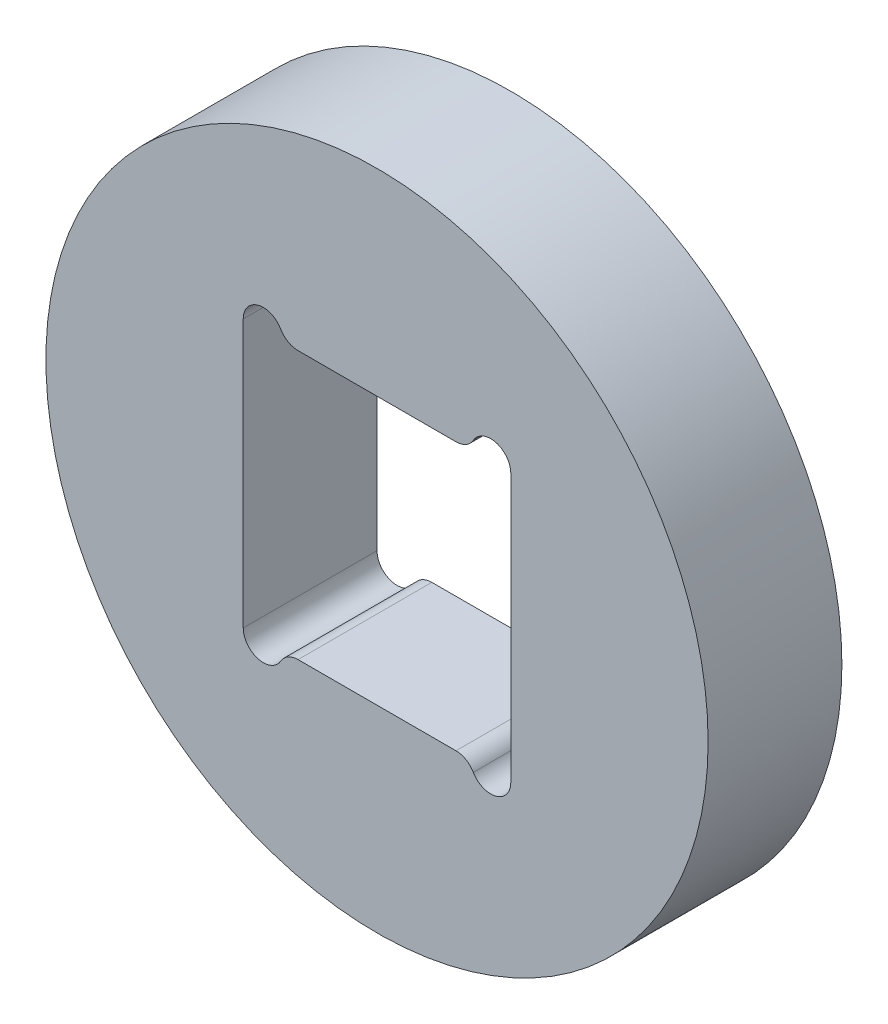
from build123d import *

# Parameters (mm, degrees)
ESQUISSE1_R        = 24.75
BOSS_EXTRU_1_DEPTH = 10


with BuildPart() as part:
    # Esquisse1 → Boss.-Extru.1 (new body)
    with BuildSketch(Plane.XY):
        Circle(ESQUISSE1_R)
        with BuildLine():
            Line((-5.901923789, 10), (5.901923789, 10))
            ThreePointArc((5.901923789, 10), (6.651923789, 10.200961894), (7.200961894, 10.75))
            ThreePointArc((7.200961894, 10.75), (8.888228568, 11.448888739), (10, 10))
            Line((10, 10), (10, -10))
            ThreePointArc((10, -10), (8.888228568, -11.448888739), (7.200961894, -10.75))
            ThreePointArc((7.200961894, -10.75), (6.651923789, -10.200961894), (5.901923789, -10))
            Line((5.901923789, -10), (-5.901923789, -10))
            ThreePointArc((-5.901923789, -10), (-6.651923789, -10.200961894), (-7.200961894, -10.75))
            ThreePointArc((-7.200961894, -10.75), (-8.888228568, -11.448888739), (-10, -10))
            Line((-10, -10), (-10, 10))
            ThreePointArc((-10, 10), (-8.888228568, 11.448888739), (-7.200961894, 10.75))
            ThreePointArc((-7.200961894, 10.75), (-6.651923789, 10.200961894), (-5.901923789, 10))
        make_face(mode=Mode.SUBTRACT)
    extrude(amount=BOSS_EXTRU_1_DEPTH)


solid = part.part
